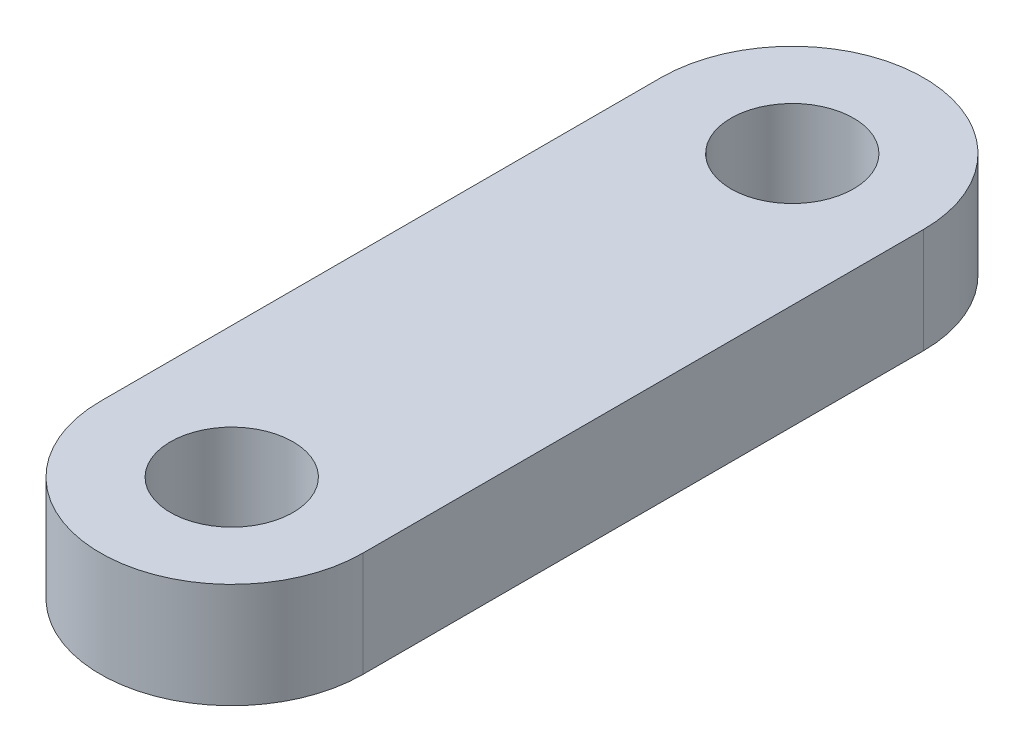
ISO-10303-21;
HEADER;
FILE_DESCRIPTION(('STEP AP214'),'2;1');
FILE_NAME('part.step','',(''),(''),'','','');
FILE_SCHEMA(('AUTOMOTIVE_DESIGN { 1 0 10303 214 1 1 1 1 }'));
ENDSEC;
DATA;
#1=APPLICATION_CONTEXT('core data for automotive mechanical design processes');
#2=APPLICATION_PROTOCOL_DEFINITION('international standard','automotive_design',2000,#1);
#3=PRODUCT_CONTEXT('',#1,'mechanical');
#4=PRODUCT('Part','Part','',(#3));
#5=PRODUCT_RELATED_PRODUCT_CATEGORY('part','',(#4));
#6=PRODUCT_DEFINITION_FORMATION('','',#4);
#7=PRODUCT_DEFINITION_CONTEXT('part definition',#1,'design');
#8=PRODUCT_DEFINITION('design','',#6,#7);
#9=PRODUCT_DEFINITION_SHAPE('','',#8);
#10=(LENGTH_UNIT() NAMED_UNIT(*) SI_UNIT(.MILLI.,.METRE.));
#11=(NAMED_UNIT(*) PLANE_ANGLE_UNIT() SI_UNIT($,.RADIAN.));
#12=(NAMED_UNIT(*) SI_UNIT($,.STERADIAN.) SOLID_ANGLE_UNIT());
#13=UNCERTAINTY_MEASURE_WITH_UNIT(LENGTH_MEASURE(1.E-05),#10,'distance_accuracy_value','');
#14=(GEOMETRIC_REPRESENTATION_CONTEXT(3) GLOBAL_UNCERTAINTY_ASSIGNED_CONTEXT((#13)) GLOBAL_UNIT_ASSIGNED_CONTEXT((#10,
#11,#12)) REPRESENTATION_CONTEXT('',''));
#15=CARTESIAN_POINT('',(0.,0.,0.));
#16=DIRECTION('',(0.,0.,1.));
#17=DIRECTION('',(1.,0.,0.));
#18=AXIS2_PLACEMENT_3D('',#15,#16,#17);
#19=CARTESIAN_POINT('',(0.,3.,-8.));
#20=DIRECTION('',(0.,-1.,0.));
#21=DIRECTION('',(0.,0.,-1.));
#22=AXIS2_PLACEMENT_3D('',#19,#20,#21);
#23=PLANE('',#22);
#24=CARTESIAN_POINT('',(0.,3.,-8.));
#25=DIRECTION('',(0.,1.,0.));
#26=DIRECTION('',(0.,0.,-1.));
#27=AXIS2_PLACEMENT_3D('',#24,#25,#26);
#28=CIRCLE('',#27,3.75);
#29=CARTESIAN_POINT('',(3.75,3.,-8.));
#30=VERTEX_POINT('',#29);
#31=CARTESIAN_POINT('',(-3.75,3.,-8.));
#32=VERTEX_POINT('',#31);
#33=EDGE_CURVE('E87',#30,#32,#28,.T.);
#34=ORIENTED_EDGE('',*,*,#33,.T.);
#35=DIRECTION('',(0.,0.,1.));
#36=VECTOR('',#35,1.);
#37=CARTESIAN_POINT('',(-3.75,3.,-8.));
#38=LINE('',#37,#36);
#39=CARTESIAN_POINT('',(-3.75,3.,8.));
#40=VERTEX_POINT('',#39);
#41=EDGE_CURVE('E115',#32,#40,#38,.T.);
#42=ORIENTED_EDGE('',*,*,#41,.T.);
#43=CARTESIAN_POINT('',(0.,3.,8.));
#44=DIRECTION('',(0.,-1.,0.));
#45=DIRECTION('',(0.,0.,1.));
#46=AXIS2_PLACEMENT_3D('',#43,#44,#45);
#47=CIRCLE('',#46,3.75);
#48=CARTESIAN_POINT('',(3.75,3.,8.));
#49=VERTEX_POINT('',#48);
#50=EDGE_CURVE('E94',#49,#40,#47,.T.);
#51=ORIENTED_EDGE('',*,*,#50,.F.);
#52=DIRECTION('',(0.,0.,-1.));
#53=VECTOR('',#52,1.);
#54=CARTESIAN_POINT('',(3.75,3.,-8.));
#55=LINE('',#54,#53);
#56=EDGE_CURVE('E54',#49,#30,#55,.T.);
#57=ORIENTED_EDGE('',*,*,#56,.T.);
#58=EDGE_LOOP('',(#34,#42,#51,#57));
#59=FACE_BOUND('',#58,.T.);
#60=CARTESIAN_POINT('',(0.,3.,-8.));
#61=DIRECTION('',(0.,1.,0.));
#62=DIRECTION('',(0.,0.,1.));
#63=AXIS2_PLACEMENT_3D('',#60,#61,#62);
#64=CIRCLE('',#63,1.75);
#65=CARTESIAN_POINT('',(0.,3.,-6.25));
#66=VERTEX_POINT('',#65);
#67=EDGE_CURVE('E109',#66,#66,#64,.T.);
#68=ORIENTED_EDGE('',*,*,#67,.F.);
#69=EDGE_LOOP('',(#68));
#70=FACE_BOUND('',#69,.T.);
#71=CARTESIAN_POINT('',(0.,3.,8.));
#72=DIRECTION('',(0.,-1.,0.));
#73=DIRECTION('',(0.,0.,-1.));
#74=AXIS2_PLACEMENT_3D('',#71,#72,#73);
#75=CIRCLE('',#74,1.75);
#76=CARTESIAN_POINT('',(0.,3.,6.25));
#77=VERTEX_POINT('',#76);
#78=EDGE_CURVE('E99',#77,#77,#75,.T.);
#79=ORIENTED_EDGE('',*,*,#78,.T.);
#80=EDGE_LOOP('',(#79));
#81=FACE_BOUND('',#80,.T.);
#82=ADVANCED_FACE('F37',(#59,#70,#81),#23,.F.);
#83=CARTESIAN_POINT('',(0.,0.,-8.));
#84=DIRECTION('',(0.,-1.,0.));
#85=DIRECTION('',(0.,0.,-1.));
#86=AXIS2_PLACEMENT_3D('',#83,#84,#85);
#87=PLANE('',#86);
#88=CARTESIAN_POINT('',(0.,0.,-8.));
#89=DIRECTION('',(0.,1.,0.));
#90=DIRECTION('',(0.,0.,-1.));
#91=AXIS2_PLACEMENT_3D('',#88,#89,#90);
#92=CIRCLE('',#91,3.75);
#93=CARTESIAN_POINT('',(3.75,0.,-8.));
#94=VERTEX_POINT('',#93);
#95=CARTESIAN_POINT('',(-3.75,0.,-8.));
#96=VERTEX_POINT('',#95);
#97=EDGE_CURVE('E85',#94,#96,#92,.T.);
#98=ORIENTED_EDGE('',*,*,#97,.F.);
#99=DIRECTION('',(0.,0.,-1.));
#100=VECTOR('',#99,1.);
#101=CARTESIAN_POINT('',(3.75,0.,-8.));
#102=LINE('',#101,#100);
#103=CARTESIAN_POINT('',(3.75,0.,8.));
#104=VERTEX_POINT('',#103);
#105=EDGE_CURVE('E79',#104,#94,#102,.T.);
#106=ORIENTED_EDGE('',*,*,#105,.F.);
#107=CARTESIAN_POINT('',(0.,0.,8.));
#108=DIRECTION('',(0.,-1.,0.));
#109=DIRECTION('',(0.,0.,1.));
#110=AXIS2_PLACEMENT_3D('',#107,#108,#109);
#111=CIRCLE('',#110,3.75);
#112=CARTESIAN_POINT('',(-3.75,0.,8.));
#113=VERTEX_POINT('',#112);
#114=EDGE_CURVE('E83',#104,#113,#111,.T.);
#115=ORIENTED_EDGE('',*,*,#114,.T.);
#116=DIRECTION('',(0.,0.,1.));
#117=VECTOR('',#116,1.);
#118=CARTESIAN_POINT('',(-3.75,0.,-8.));
#119=LINE('',#118,#117);
#120=EDGE_CURVE('E66',#96,#113,#119,.T.);
#121=ORIENTED_EDGE('',*,*,#120,.F.);
#122=EDGE_LOOP('',(#98,#106,#115,#121));
#123=FACE_BOUND('',#122,.T.);
#124=CARTESIAN_POINT('',(0.,0.,-8.));
#125=DIRECTION('',(0.,1.,0.));
#126=DIRECTION('',(0.,0.,1.));
#127=AXIS2_PLACEMENT_3D('',#124,#125,#126);
#128=CIRCLE('',#127,1.75);
#129=CARTESIAN_POINT('',(0.,0.,-6.25));
#130=VERTEX_POINT('',#129);
#131=EDGE_CURVE('E108',#130,#130,#128,.T.);
#132=ORIENTED_EDGE('',*,*,#131,.T.);
#133=EDGE_LOOP('',(#132));
#134=FACE_BOUND('',#133,.T.);
#135=CARTESIAN_POINT('',(0.,0.,8.));
#136=DIRECTION('',(0.,-1.,0.));
#137=DIRECTION('',(0.,0.,-1.));
#138=AXIS2_PLACEMENT_3D('',#135,#136,#137);
#139=CIRCLE('',#138,1.75);
#140=CARTESIAN_POINT('',(0.,0.,6.25));
#141=VERTEX_POINT('',#140);
#142=EDGE_CURVE('E103',#141,#141,#139,.T.);
#143=ORIENTED_EDGE('',*,*,#142,.F.);
#144=EDGE_LOOP('',(#143));
#145=FACE_BOUND('',#144,.T.);
#146=ADVANCED_FACE('F80',(#123,#134,#145),#87,.T.);
#147=CARTESIAN_POINT('',(0.,3.,-8.));
#148=DIRECTION('',(0.,-1.,0.));
#149=DIRECTION('',(0.,0.,-1.));
#150=AXIS2_PLACEMENT_3D('',#147,#148,#149);
#151=CYLINDRICAL_SURFACE('',#150,3.75);
#152=ORIENTED_EDGE('',*,*,#97,.T.);
#153=DIRECTION('',(0.,-1.,0.));
#154=VECTOR('',#153,1.);
#155=CARTESIAN_POINT('',(-3.75,3.,-8.));
#156=LINE('',#155,#154);
#157=EDGE_CURVE('E11',#32,#96,#156,.T.);
#158=ORIENTED_EDGE('',*,*,#157,.F.);
#159=ORIENTED_EDGE('',*,*,#33,.F.);
#160=DIRECTION('',(0.,-1.,0.));
#161=VECTOR('',#160,1.);
#162=CARTESIAN_POINT('',(3.75,3.,-8.));
#163=LINE('',#162,#161);
#164=EDGE_CURVE('E46',#30,#94,#163,.T.);
#165=ORIENTED_EDGE('',*,*,#164,.T.);
#166=EDGE_LOOP('',(#152,#158,#159,#165));
#167=FACE_BOUND('',#166,.T.);
#168=ADVANCED_FACE('F39',(#167),#151,.T.);
#169=CARTESIAN_POINT('',(-3.75,3.,-8.));
#170=DIRECTION('',(1.,0.,0.));
#171=DIRECTION('',(0.,0.,-1.));
#172=AXIS2_PLACEMENT_3D('',#169,#170,#171);
#173=PLANE('',#172);
#174=ORIENTED_EDGE('',*,*,#120,.T.);
#175=DIRECTION('',(0.,-1.,0.));
#176=VECTOR('',#175,1.);
#177=CARTESIAN_POINT('',(-3.75,3.,8.));
#178=LINE('',#177,#176);
#179=EDGE_CURVE('E93',#40,#113,#178,.T.);
#180=ORIENTED_EDGE('',*,*,#179,.F.);
#181=ORIENTED_EDGE('',*,*,#41,.F.);
#182=ORIENTED_EDGE('',*,*,#157,.T.);
#183=EDGE_LOOP('',(#174,#180,#181,#182));
#184=FACE_BOUND('',#183,.T.);
#185=ADVANCED_FACE('F124',(#184),#173,.F.);
#186=CARTESIAN_POINT('',(3.75,3.,-8.));
#187=DIRECTION('',(-1.,0.,0.));
#188=DIRECTION('',(0.,0.,1.));
#189=AXIS2_PLACEMENT_3D('',#186,#187,#188);
#190=PLANE('',#189);
#191=ORIENTED_EDGE('',*,*,#105,.T.);
#192=ORIENTED_EDGE('',*,*,#164,.F.);
#193=ORIENTED_EDGE('',*,*,#56,.F.);
#194=DIRECTION('',(0.,-1.,0.));
#195=VECTOR('',#194,1.);
#196=CARTESIAN_POINT('',(3.75,3.,8.));
#197=LINE('',#196,#195);
#198=EDGE_CURVE('E89',#49,#104,#197,.T.);
#199=ORIENTED_EDGE('',*,*,#198,.T.);
#200=EDGE_LOOP('',(#191,#192,#193,#199));
#201=FACE_BOUND('',#200,.T.);
#202=ADVANCED_FACE('F90',(#201),#190,.F.);
#203=CARTESIAN_POINT('',(0.,3.,-8.));
#204=DIRECTION('',(0.,-1.,0.));
#205=DIRECTION('',(0.,0.,-1.));
#206=AXIS2_PLACEMENT_3D('',#203,#204,#205);
#207=CYLINDRICAL_SURFACE('',#206,1.75);
#208=ORIENTED_EDGE('',*,*,#67,.T.);
#209=EDGE_LOOP('',(#208));
#210=FACE_BOUND('',#209,.T.);
#211=ORIENTED_EDGE('',*,*,#131,.F.);
#212=EDGE_LOOP('',(#211));
#213=FACE_BOUND('',#212,.T.);
#214=ADVANCED_FACE('F130',(#210,#213),#207,.F.);
#215=CARTESIAN_POINT('',(0.,3.,8.));
#216=DIRECTION('',(0.,-1.,0.));
#217=DIRECTION('',(0.,0.,1.));
#218=AXIS2_PLACEMENT_3D('',#215,#216,#217);
#219=CYLINDRICAL_SURFACE('',#218,3.75);
#220=ORIENTED_EDGE('',*,*,#114,.F.);
#221=ORIENTED_EDGE('',*,*,#198,.F.);
#222=ORIENTED_EDGE('',*,*,#50,.T.);
#223=ORIENTED_EDGE('',*,*,#179,.T.);
#224=EDGE_LOOP('',(#220,#221,#222,#223));
#225=FACE_BOUND('',#224,.T.);
#226=ADVANCED_FACE('F97',(#225),#219,.T.);
#227=CARTESIAN_POINT('',(0.,3.,8.));
#228=DIRECTION('',(0.,-1.,0.));
#229=DIRECTION('',(0.,0.,1.));
#230=AXIS2_PLACEMENT_3D('',#227,#228,#229);
#231=CYLINDRICAL_SURFACE('',#230,1.75);
#232=ORIENTED_EDGE('',*,*,#78,.F.);
#233=EDGE_LOOP('',(#232));
#234=FACE_BOUND('',#233,.T.);
#235=ORIENTED_EDGE('',*,*,#142,.T.);
#236=EDGE_LOOP('',(#235));
#237=FACE_BOUND('',#236,.T.);
#238=ADVANCED_FACE('F144',(#234,#237),#231,.F.);
#239=CLOSED_SHELL('',(#82,#146,#168,#185,#202,#214,#226,#238));
#240=MANIFOLD_SOLID_BREP('B2',#239);
#241=ADVANCED_BREP_SHAPE_REPRESENTATION('',(#18,#240),#14);
#242=SHAPE_DEFINITION_REPRESENTATION(#9,#241);
ENDSEC;
END-ISO-10303-21;
